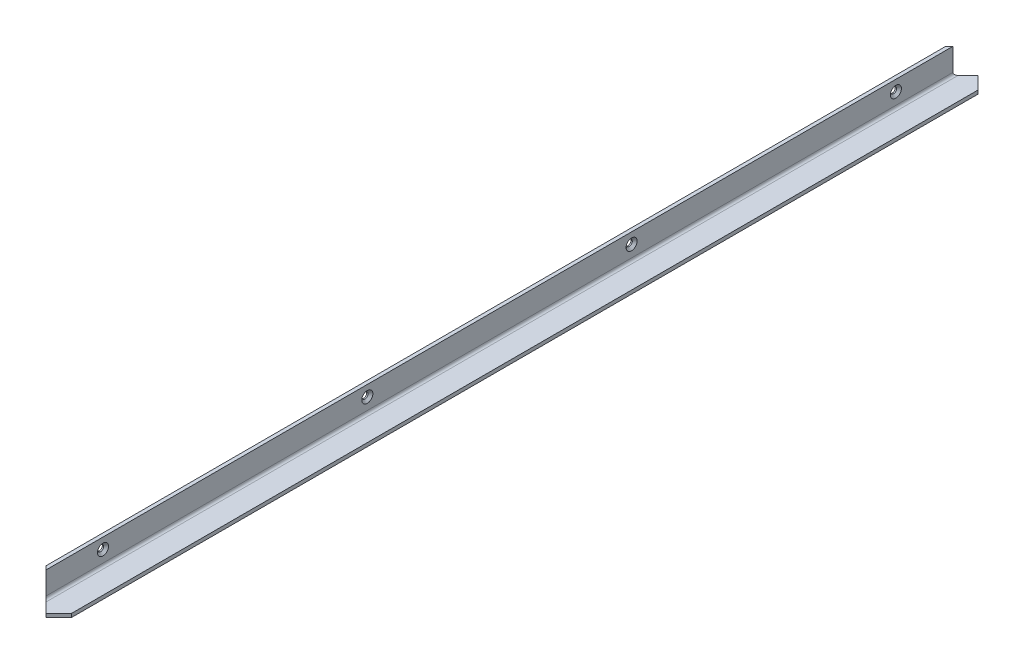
ISO-10303-21;
HEADER;
FILE_DESCRIPTION(('STEP AP214'),'2;1');
FILE_NAME('part.step','',(''),(''),'','','');
FILE_SCHEMA(('AUTOMOTIVE_DESIGN { 1 0 10303 214 1 1 1 1 }'));
ENDSEC;
DATA;
#1=APPLICATION_CONTEXT('core data for automotive mechanical design processes');
#2=APPLICATION_PROTOCOL_DEFINITION('international standard','automotive_design',2000,#1);
#3=PRODUCT_CONTEXT('',#1,'mechanical');
#4=PRODUCT('Part','Part','',(#3));
#5=PRODUCT_RELATED_PRODUCT_CATEGORY('part','',(#4));
#6=PRODUCT_DEFINITION_FORMATION('','',#4);
#7=PRODUCT_DEFINITION_CONTEXT('part definition',#1,'design');
#8=PRODUCT_DEFINITION('design','',#6,#7);
#9=PRODUCT_DEFINITION_SHAPE('','',#8);
#10=(LENGTH_UNIT() NAMED_UNIT(*) SI_UNIT(.MILLI.,.METRE.));
#11=(NAMED_UNIT(*) PLANE_ANGLE_UNIT() SI_UNIT($,.RADIAN.));
#12=(NAMED_UNIT(*) SI_UNIT($,.STERADIAN.) SOLID_ANGLE_UNIT());
#13=UNCERTAINTY_MEASURE_WITH_UNIT(LENGTH_MEASURE(1.E-05),#10,'distance_accuracy_value','');
#14=(GEOMETRIC_REPRESENTATION_CONTEXT(3) GLOBAL_UNCERTAINTY_ASSIGNED_CONTEXT((#13)) GLOBAL_UNIT_ASSIGNED_CONTEXT((#10,
#11,#12)) REPRESENTATION_CONTEXT('',''));
#15=CARTESIAN_POINT('',(0.,0.,0.));
#16=DIRECTION('',(0.,0.,1.));
#17=DIRECTION('',(1.,0.,0.));
#18=AXIS2_PLACEMENT_3D('',#15,#16,#17);
#19=CARTESIAN_POINT('',(0.,0.,1689.1));
#20=DIRECTION('',(0.,1.,0.));
#21=DIRECTION('',(0.,0.,1.));
#22=AXIS2_PLACEMENT_3D('',#19,#20,#21);
#23=PLANE('',#22);
#24=DIRECTION('',(0.,0.,-1.));
#25=VECTOR('',#24,1.);
#26=CARTESIAN_POINT('',(0.,0.,1689.1));
#27=LINE('',#26,#25);
#28=CARTESIAN_POINT('',(0.,0.,1638.3));
#29=VERTEX_POINT('',#28);
#30=CARTESIAN_POINT('',(0.,0.,50.8));
#31=VERTEX_POINT('',#30);
#32=EDGE_CURVE('E269',#29,#31,#27,.T.);
#33=ORIENTED_EDGE('',*,*,#32,.T.);
#34=DIRECTION('',(-0.707106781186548,0.,0.707106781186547));
#35=VECTOR('',#34,1.);
#36=CARTESIAN_POINT('',(28.4957415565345,0.,22.3042584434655));
#37=LINE('',#36,#35);
#38=CARTESIAN_POINT('',(28.4957415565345,0.,22.3042584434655));
#39=VERTEX_POINT('',#38);
#40=EDGE_CURVE('E120',#39,#31,#37,.T.);
#41=ORIENTED_EDGE('',*,*,#40,.F.);
#42=DIRECTION('',(-0.707106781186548,0.,-0.707106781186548));
#43=VECTOR('',#42,1.);
#44=CARTESIAN_POINT('',(50.8,0.,44.608516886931));
#45=LINE('',#44,#43);
#46=CARTESIAN_POINT('',(50.8,0.,44.608516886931));
#47=VERTEX_POINT('',#46);
#48=EDGE_CURVE('E104',#47,#39,#45,.T.);
#49=ORIENTED_EDGE('',*,*,#48,.F.);
#50=DIRECTION('',(0.,0.,-1.));
#51=VECTOR('',#50,1.);
#52=CARTESIAN_POINT('',(50.8,0.,1689.1));
#53=LINE('',#52,#51);
#54=CARTESIAN_POINT('',(50.8,0.,1644.49148311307));
#55=VERTEX_POINT('',#54);
#56=EDGE_CURVE('E119',#55,#47,#53,.T.);
#57=ORIENTED_EDGE('',*,*,#56,.F.);
#58=DIRECTION('',(0.707106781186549,0.,-0.707106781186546));
#59=VECTOR('',#58,1.);
#60=CARTESIAN_POINT('',(50.8,0.,1644.49148311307));
#61=LINE('',#60,#59);
#62=CARTESIAN_POINT('',(28.4957415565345,0.,1666.79574155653));
#63=VERTEX_POINT('',#62);
#64=EDGE_CURVE('E277',#63,#55,#61,.T.);
#65=ORIENTED_EDGE('',*,*,#64,.F.);
#66=DIRECTION('',(0.70710678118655,0.,0.707106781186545));
#67=VECTOR('',#66,1.);
#68=CARTESIAN_POINT('',(28.4957415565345,0.,1666.79574155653));
#69=LINE('',#68,#67);
#70=EDGE_CURVE('E247',#29,#63,#69,.T.);
#71=ORIENTED_EDGE('',*,*,#70,.F.);
#72=EDGE_LOOP('',(#33,#41,#49,#57,#65,#71));
#73=FACE_BOUND('',#72,.T.);
#74=ADVANCED_FACE('F27',(#73),#23,.F.);
#75=CARTESIAN_POINT('',(50.8,6.35,1689.1));
#76=DIRECTION('',(1.,0.,0.));
#77=DIRECTION('',(0.,0.,-1.));
#78=AXIS2_PLACEMENT_3D('',#75,#76,#77);
#79=PLANE('',#78);
#80=DIRECTION('',(0.,-1.,0.));
#81=VECTOR('',#80,1.);
#82=CARTESIAN_POINT('',(50.8,50.8,44.608516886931));
#83=LINE('',#82,#81);
#84=CARTESIAN_POINT('',(50.8,6.35,44.608516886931));
#85=VERTEX_POINT('',#84);
#86=EDGE_CURVE('E100',#85,#47,#83,.T.);
#87=ORIENTED_EDGE('',*,*,#86,.F.);
#88=DIRECTION('',(0.,0.,-1.));
#89=VECTOR('',#88,1.);
#90=CARTESIAN_POINT('',(50.8,6.35,1689.1));
#91=LINE('',#90,#89);
#92=CARTESIAN_POINT('',(50.8,6.35,1644.49148311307));
#93=VERTEX_POINT('',#92);
#94=EDGE_CURVE('E127',#93,#85,#91,.T.);
#95=ORIENTED_EDGE('',*,*,#94,.F.);
#96=DIRECTION('',(0.,-1.,0.));
#97=VECTOR('',#96,1.);
#98=CARTESIAN_POINT('',(50.8,50.8,1644.49148311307));
#99=LINE('',#98,#97);
#100=EDGE_CURVE('E125',#93,#55,#99,.T.);
#101=ORIENTED_EDGE('',*,*,#100,.T.);
#102=ORIENTED_EDGE('',*,*,#56,.T.);
#103=EDGE_LOOP('',(#87,#95,#101,#102));
#104=FACE_BOUND('',#103,.T.);
#105=ADVANCED_FACE('F124',(#104),#79,.T.);
#106=CARTESIAN_POINT('',(0.,6.35,1689.1));
#107=DIRECTION('',(0.,1.,0.));
#108=DIRECTION('',(0.,0.,1.));
#109=AXIS2_PLACEMENT_3D('',#106,#107,#108);
#110=PLANE('',#109);
#111=DIRECTION('',(0.707106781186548,0.,-0.707106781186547));
#112=VECTOR('',#111,1.);
#113=CARTESIAN_POINT('',(-819.15,6.35,869.95));
#114=LINE('',#113,#112);
#115=CARTESIAN_POINT('',(10.922,6.35,39.8780000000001));
#116=VERTEX_POINT('',#115);
#117=CARTESIAN_POINT('',(28.4957415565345,6.35,22.3042584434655));
#118=VERTEX_POINT('',#117);
#119=EDGE_CURVE('E246',#116,#118,#114,.T.);
#120=ORIENTED_EDGE('',*,*,#119,.F.);
#121=DIRECTION('',(0.,0.,-1.));
#122=VECTOR('',#121,1.);
#123=CARTESIAN_POINT('',(10.922,6.35,1689.1));
#124=LINE('',#123,#122);
#125=CARTESIAN_POINT('',(10.922,6.35,1649.222));
#126=VERTEX_POINT('',#125);
#127=EDGE_CURVE('E50',#116,#126,#124,.F.);
#128=ORIENTED_EDGE('',*,*,#127,.T.);
#129=DIRECTION('',(-0.70710678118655,0.,-0.707106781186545));
#130=VECTOR('',#129,1.);
#131=CARTESIAN_POINT('',(25.4,6.35,1663.7));
#132=LINE('',#131,#130);
#133=CARTESIAN_POINT('',(28.4957415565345,6.35,1666.79574155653));
#134=VERTEX_POINT('',#133);
#135=EDGE_CURVE('E254',#134,#126,#132,.T.);
#136=ORIENTED_EDGE('',*,*,#135,.F.);
#137=DIRECTION('',(-0.707106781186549,0.,0.707106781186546));
#138=VECTOR('',#137,1.);
#139=CARTESIAN_POINT('',(3.09574155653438,6.35,1692.19574155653));
#140=LINE('',#139,#138);
#141=EDGE_CURVE('E139',#93,#134,#140,.T.);
#142=ORIENTED_EDGE('',*,*,#141,.F.);
#143=ORIENTED_EDGE('',*,*,#94,.T.);
#144=DIRECTION('',(0.707106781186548,0.,0.707106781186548));
#145=VECTOR('',#144,1.);
#146=CARTESIAN_POINT('',(847.645741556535,6.35,841.454258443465));
#147=LINE('',#146,#145);
#148=EDGE_CURVE('E107',#118,#85,#147,.T.);
#149=ORIENTED_EDGE('',*,*,#148,.F.);
#150=EDGE_LOOP('',(#120,#128,#136,#142,#143,#149));
#151=FACE_BOUND('',#150,.T.);
#152=ADVANCED_FACE('F194',(#151),#110,.T.);
#153=CARTESIAN_POINT('',(6.35,50.8,1689.1));
#154=DIRECTION('',(1.,0.,0.));
#155=DIRECTION('',(0.,1.,0.));
#156=AXIS2_PLACEMENT_3D('',#153,#154,#155);
#157=PLANE('',#156);
#158=CARTESIAN_POINT('',(6.35,31.75,1544.066));
#159=DIRECTION('',(1.,0.,0.));
#160=DIRECTION('',(0.,1.,0.));
#161=AXIS2_PLACEMENT_3D('',#158,#159,#160);
#162=CIRCLE('',#161,9.7789999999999);
#163=CARTESIAN_POINT('',(6.35,41.5289999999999,1544.066));
#164=VERTEX_POINT('',#163);
#165=EDGE_CURVE('E162',#164,#164,#162,.F.);
#166=ORIENTED_EDGE('',*,*,#165,.T.);
#167=EDGE_LOOP('',(#166));
#168=FACE_BOUND('',#167,.T.);
#169=CARTESIAN_POINT('',(6.35,31.75,1077.722));
#170=DIRECTION('',(1.,0.,0.));
#171=DIRECTION('',(0.,1.,0.));
#172=AXIS2_PLACEMENT_3D('',#169,#170,#171);
#173=CIRCLE('',#172,9.7789999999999);
#174=CARTESIAN_POINT('',(6.35,41.5289999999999,1077.722));
#175=VERTEX_POINT('',#174);
#176=EDGE_CURVE('E159',#175,#175,#173,.F.);
#177=ORIENTED_EDGE('',*,*,#176,.T.);
#178=EDGE_LOOP('',(#177));
#179=FACE_BOUND('',#178,.T.);
#180=CARTESIAN_POINT('',(6.35,31.75,611.378));
#181=DIRECTION('',(1.,0.,0.));
#182=DIRECTION('',(0.,1.,0.));
#183=AXIS2_PLACEMENT_3D('',#180,#181,#182);
#184=CIRCLE('',#183,9.7789999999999);
#185=CARTESIAN_POINT('',(6.35,41.5289999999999,611.378));
#186=VERTEX_POINT('',#185);
#187=EDGE_CURVE('E156',#186,#186,#184,.F.);
#188=ORIENTED_EDGE('',*,*,#187,.T.);
#189=EDGE_LOOP('',(#188));
#190=FACE_BOUND('',#189,.T.);
#191=CARTESIAN_POINT('',(6.35,31.75,145.034));
#192=DIRECTION('',(1.,0.,0.));
#193=DIRECTION('',(0.,1.,0.));
#194=AXIS2_PLACEMENT_3D('',#191,#192,#193);
#195=CIRCLE('',#194,9.7789999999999);
#196=CARTESIAN_POINT('',(6.35,41.5289999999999,145.034));
#197=VERTEX_POINT('',#196);
#198=EDGE_CURVE('E153',#197,#197,#195,.F.);
#199=ORIENTED_EDGE('',*,*,#198,.T.);
#200=EDGE_LOOP('',(#199));
#201=FACE_BOUND('',#200,.T.);
#202=DIRECTION('',(0.,-1.,0.));
#203=VECTOR('',#202,1.);
#204=CARTESIAN_POINT('',(6.35,50.8,44.4500000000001));
#205=LINE('',#204,#203);
#206=CARTESIAN_POINT('',(6.3500000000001,50.8,44.4499999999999));
#207=VERTEX_POINT('',#206);
#208=CARTESIAN_POINT('',(6.35,10.922,44.4500000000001));
#209=VERTEX_POINT('',#208);
#210=EDGE_CURVE('E42',#207,#209,#205,.T.);
#211=ORIENTED_EDGE('',*,*,#210,.F.);
#212=DIRECTION('',(0.,0.,-1.));
#213=VECTOR('',#212,1.);
#214=CARTESIAN_POINT('',(6.35,50.8,1689.1));
#215=LINE('',#214,#213);
#216=CARTESIAN_POINT('',(6.35000000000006,50.8,1644.65));
#217=VERTEX_POINT('',#216);
#218=EDGE_CURVE('E131',#217,#207,#215,.T.);
#219=ORIENTED_EDGE('',*,*,#218,.F.);
#220=DIRECTION('',(0.,1.,0.));
#221=VECTOR('',#220,1.);
#222=CARTESIAN_POINT('',(6.35,50.8,1644.65));
#223=LINE('',#222,#221);
#224=CARTESIAN_POINT('',(6.35,10.922,1644.65));
#225=VERTEX_POINT('',#224);
#226=EDGE_CURVE('E251',#225,#217,#223,.T.);
#227=ORIENTED_EDGE('',*,*,#226,.F.);
#228=DIRECTION('',(0.,0.,-1.));
#229=VECTOR('',#228,1.);
#230=CARTESIAN_POINT('',(6.35,10.922,0.));
#231=LINE('',#230,#229);
#232=EDGE_CURVE('E126',#225,#209,#231,.T.);
#233=ORIENTED_EDGE('',*,*,#232,.T.);
#234=EDGE_LOOP('',(#211,#219,#227,#233));
#235=FACE_BOUND('',#234,.T.);
#236=ADVANCED_FACE('F239',(#168,#179,#190,#201,#235),#157,.T.);
#237=CARTESIAN_POINT('',(0.,50.8,1689.1));
#238=DIRECTION('',(0.,1.,0.));
#239=DIRECTION('',(0.,0.,1.));
#240=AXIS2_PLACEMENT_3D('',#237,#238,#239);
#241=PLANE('',#240);
#242=DIRECTION('',(-0.707106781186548,0.,0.707106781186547));
#243=VECTOR('',#242,1.);
#244=CARTESIAN_POINT('',(28.4957415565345,50.8,22.3042584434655));
#245=LINE('',#244,#243);
#246=CARTESIAN_POINT('',(0.,50.8,50.8));
#247=VERTEX_POINT('',#246);
#248=EDGE_CURVE('E113',#207,#247,#245,.T.);
#249=ORIENTED_EDGE('',*,*,#248,.T.);
#250=DIRECTION('',(0.,0.,-1.));
#251=VECTOR('',#250,1.);
#252=CARTESIAN_POINT('',(0.,50.8,1689.1));
#253=LINE('',#252,#251);
#254=CARTESIAN_POINT('',(0.,50.8,1638.3));
#255=VERTEX_POINT('',#254);
#256=EDGE_CURVE('E271',#255,#247,#253,.T.);
#257=ORIENTED_EDGE('',*,*,#256,.F.);
#258=DIRECTION('',(0.70710678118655,0.,0.707106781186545));
#259=VECTOR('',#258,1.);
#260=CARTESIAN_POINT('',(28.4957415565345,50.8,1666.79574155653));
#261=LINE('',#260,#259);
#262=EDGE_CURVE('E275',#255,#217,#261,.T.);
#263=ORIENTED_EDGE('',*,*,#262,.T.);
#264=ORIENTED_EDGE('',*,*,#218,.T.);
#265=EDGE_LOOP('',(#249,#257,#263,#264));
#266=FACE_BOUND('',#265,.T.);
#267=ADVANCED_FACE('F235',(#266),#241,.T.);
#268=CARTESIAN_POINT('',(0.,50.8,1689.1));
#269=DIRECTION('',(1.,0.,0.));
#270=DIRECTION('',(0.,1.,0.));
#271=AXIS2_PLACEMENT_3D('',#268,#269,#270);
#272=PLANE('',#271);
#273=CARTESIAN_POINT('',(0.,31.75,1077.722));
#274=DIRECTION('',(-1.,0.,0.));
#275=DIRECTION('',(0.,-1.,0.));
#276=AXIS2_PLACEMENT_3D('',#273,#274,#275);
#277=CIRCLE('',#276,5.20699999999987);
#278=CARTESIAN_POINT('',(0.,26.5430000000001,1077.722));
#279=VERTEX_POINT('',#278);
#280=EDGE_CURVE('E121',#279,#279,#277,.T.);
#281=ORIENTED_EDGE('',*,*,#280,.F.);
#282=EDGE_LOOP('',(#281));
#283=FACE_BOUND('',#282,.T.);
#284=CARTESIAN_POINT('',(0.,31.75,1544.066));
#285=DIRECTION('',(-1.,0.,0.));
#286=DIRECTION('',(0.,-1.,0.));
#287=AXIS2_PLACEMENT_3D('',#284,#285,#286);
#288=CIRCLE('',#287,5.20699999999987);
#289=CARTESIAN_POINT('',(0.,26.5430000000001,1544.066));
#290=VERTEX_POINT('',#289);
#291=EDGE_CURVE('E259',#290,#290,#288,.T.);
#292=ORIENTED_EDGE('',*,*,#291,.F.);
#293=EDGE_LOOP('',(#292));
#294=FACE_BOUND('',#293,.T.);
#295=ORIENTED_EDGE('',*,*,#256,.T.);
#296=DIRECTION('',(0.,-1.,0.));
#297=VECTOR('',#296,1.);
#298=CARTESIAN_POINT('',(0.,50.8,50.8));
#299=LINE('',#298,#297);
#300=EDGE_CURVE('E286',#247,#31,#299,.T.);
#301=ORIENTED_EDGE('',*,*,#300,.T.);
#302=ORIENTED_EDGE('',*,*,#32,.F.);
#303=DIRECTION('',(0.,-1.,0.));
#304=VECTOR('',#303,1.);
#305=CARTESIAN_POINT('',(0.,50.8,1638.3));
#306=LINE('',#305,#304);
#307=EDGE_CURVE('E264',#255,#29,#306,.T.);
#308=ORIENTED_EDGE('',*,*,#307,.F.);
#309=EDGE_LOOP('',(#295,#301,#302,#308));
#310=FACE_BOUND('',#309,.T.);
#311=CARTESIAN_POINT('',(0.,31.75,611.378));
#312=DIRECTION('',(-1.,0.,0.));
#313=DIRECTION('',(0.,-1.,0.));
#314=AXIS2_PLACEMENT_3D('',#311,#312,#313);
#315=CIRCLE('',#314,5.20699999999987);
#316=CARTESIAN_POINT('',(0.,26.5430000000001,611.378));
#317=VERTEX_POINT('',#316);
#318=EDGE_CURVE('E144',#317,#317,#315,.T.);
#319=ORIENTED_EDGE('',*,*,#318,.F.);
#320=EDGE_LOOP('',(#319));
#321=FACE_BOUND('',#320,.T.);
#322=CARTESIAN_POINT('',(0.,31.75,145.034));
#323=DIRECTION('',(-1.,0.,0.));
#324=DIRECTION('',(0.,-1.,0.));
#325=AXIS2_PLACEMENT_3D('',#322,#323,#324);
#326=CIRCLE('',#325,5.20699999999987);
#327=CARTESIAN_POINT('',(0.,26.5430000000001,145.034));
#328=VERTEX_POINT('',#327);
#329=EDGE_CURVE('E147',#328,#328,#326,.T.);
#330=ORIENTED_EDGE('',*,*,#329,.F.);
#331=EDGE_LOOP('',(#330));
#332=FACE_BOUND('',#331,.T.);
#333=ADVANCED_FACE('F231',(#283,#294,#310,#321,#332),#272,.F.);
#334=CARTESIAN_POINT('',(10.922,10.922,1689.1));
#335=DIRECTION('',(0.,0.,1.));
#336=DIRECTION('',(1.,0.,0.));
#337=AXIS2_PLACEMENT_3D('',#334,#335,#336);
#338=CYLINDRICAL_SURFACE('',#337,4.572);
#339=ORIENTED_EDGE('',*,*,#127,.F.);
#340=CARTESIAN_POINT('',(10.922,10.922,39.8780000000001));
#341=DIRECTION('',(0.707106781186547,0.,0.707106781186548));
#342=DIRECTION('',(-0.707106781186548,0.,0.707106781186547));
#343=AXIS2_PLACEMENT_3D('',#340,#341,#342);
#344=ELLIPSE('',#343,6.46578440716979,4.572);
#345=EDGE_CURVE('E141',#116,#209,#344,.F.);
#346=ORIENTED_EDGE('',*,*,#345,.T.);
#347=ORIENTED_EDGE('',*,*,#232,.F.);
#348=CARTESIAN_POINT('',(10.922,10.922,1649.222));
#349=DIRECTION('',(0.707106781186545,0.,-0.707106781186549));
#350=DIRECTION('',(0.70710678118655,0.,0.707106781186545));
#351=AXIS2_PLACEMENT_3D('',#348,#349,#350);
#352=ELLIPSE('',#351,6.46578440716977,4.572);
#353=EDGE_CURVE('E136',#225,#126,#352,.F.);
#354=ORIENTED_EDGE('',*,*,#353,.T.);
#355=EDGE_LOOP('',(#339,#346,#347,#354));
#356=FACE_BOUND('',#355,.T.);
#357=ADVANCED_FACE('F227',(#356),#338,.F.);
#358=CARTESIAN_POINT('',(50.8,31.75,1544.066));
#359=DIRECTION('',(-1.,0.,0.));
#360=DIRECTION('',(0.,-1.,0.));
#361=AXIS2_PLACEMENT_3D('',#358,#359,#360);
#362=CYLINDRICAL_SURFACE('',#361,5.20699999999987);
#363=CARTESIAN_POINT('',(2.37562103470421,31.75,1544.066));
#364=DIRECTION('',(1.,0.,0.));
#365=DIRECTION('',(0.,0.,-1.));
#366=AXIS2_PLACEMENT_3D('',#363,#364,#365);
#367=CIRCLE('',#366,5.20699999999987);
#368=CARTESIAN_POINT('',(2.37562103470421,31.75,1538.859));
#369=VERTEX_POINT('',#368);
#370=EDGE_CURVE('E150',#369,#369,#367,.T.);
#371=ORIENTED_EDGE('',*,*,#370,.T.);
#372=EDGE_LOOP('',(#371));
#373=FACE_BOUND('',#372,.T.);
#374=ORIENTED_EDGE('',*,*,#291,.T.);
#375=EDGE_LOOP('',(#374));
#376=FACE_BOUND('',#375,.T.);
#377=ADVANCED_FACE('F221',(#373,#376),#362,.F.);
#378=CARTESIAN_POINT('',(50.8,50.8,1644.49148311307));
#379=DIRECTION('',(-0.707106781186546,0.,-0.707106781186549));
#380=DIRECTION('',(-0.707106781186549,0.,0.707106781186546));
#381=AXIS2_PLACEMENT_3D('',#378,#379,#380);
#382=PLANE('',#381);
#383=ORIENTED_EDGE('',*,*,#141,.T.);
#384=DIRECTION('',(0.,-1.,0.));
#385=VECTOR('',#384,1.);
#386=CARTESIAN_POINT('',(28.4957415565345,50.8,1666.79574155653));
#387=LINE('',#386,#385);
#388=EDGE_CURVE('E261',#134,#63,#387,.T.);
#389=ORIENTED_EDGE('',*,*,#388,.T.);
#390=ORIENTED_EDGE('',*,*,#64,.T.);
#391=ORIENTED_EDGE('',*,*,#100,.F.);
#392=EDGE_LOOP('',(#383,#389,#390,#391));
#393=FACE_BOUND('',#392,.T.);
#394=ADVANCED_FACE('F218',(#393),#382,.F.);
#395=CARTESIAN_POINT('',(28.4957415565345,50.8,1666.79574155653));
#396=DIRECTION('',(0.707106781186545,0.,-0.707106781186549));
#397=DIRECTION('',(-0.70710678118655,0.,-0.707106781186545));
#398=AXIS2_PLACEMENT_3D('',#395,#396,#397);
#399=PLANE('',#398);
#400=ORIENTED_EDGE('',*,*,#135,.T.);
#401=ORIENTED_EDGE('',*,*,#353,.F.);
#402=ORIENTED_EDGE('',*,*,#226,.T.);
#403=ORIENTED_EDGE('',*,*,#262,.F.);
#404=ORIENTED_EDGE('',*,*,#307,.T.);
#405=ORIENTED_EDGE('',*,*,#70,.T.);
#406=ORIENTED_EDGE('',*,*,#388,.F.);
#407=EDGE_LOOP('',(#400,#401,#402,#403,#404,#405,#406));
#408=FACE_BOUND('',#407,.T.);
#409=ADVANCED_FACE('F216',(#408),#399,.F.);
#410=CARTESIAN_POINT('',(28.4957415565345,50.8,22.3042584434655));
#411=DIRECTION('',(0.707106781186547,0.,0.707106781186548));
#412=DIRECTION('',(0.707106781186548,0.,-0.707106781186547));
#413=AXIS2_PLACEMENT_3D('',#410,#411,#412);
#414=PLANE('',#413);
#415=ORIENTED_EDGE('',*,*,#119,.T.);
#416=DIRECTION('',(0.,-1.,0.));
#417=VECTOR('',#416,1.);
#418=CARTESIAN_POINT('',(28.4957415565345,50.8,22.3042584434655));
#419=LINE('',#418,#417);
#420=EDGE_CURVE('E112',#118,#39,#419,.T.);
#421=ORIENTED_EDGE('',*,*,#420,.T.);
#422=ORIENTED_EDGE('',*,*,#40,.T.);
#423=ORIENTED_EDGE('',*,*,#300,.F.);
#424=ORIENTED_EDGE('',*,*,#248,.F.);
#425=ORIENTED_EDGE('',*,*,#210,.T.);
#426=ORIENTED_EDGE('',*,*,#345,.F.);
#427=EDGE_LOOP('',(#415,#421,#422,#423,#424,#425,#426));
#428=FACE_BOUND('',#427,.T.);
#429=ADVANCED_FACE('F210',(#428),#414,.F.);
#430=CARTESIAN_POINT('',(50.8,50.8,44.608516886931));
#431=DIRECTION('',(-0.707106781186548,0.,0.707106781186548));
#432=DIRECTION('',(0.707106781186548,0.,0.707106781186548));
#433=AXIS2_PLACEMENT_3D('',#430,#431,#432);
#434=PLANE('',#433);
#435=ORIENTED_EDGE('',*,*,#148,.T.);
#436=ORIENTED_EDGE('',*,*,#86,.T.);
#437=ORIENTED_EDGE('',*,*,#48,.T.);
#438=ORIENTED_EDGE('',*,*,#420,.F.);
#439=EDGE_LOOP('',(#435,#436,#437,#438));
#440=FACE_BOUND('',#439,.T.);
#441=ADVANCED_FACE('F102',(#440),#434,.F.);
#442=CARTESIAN_POINT('',(50.8,31.75,1077.722));
#443=DIRECTION('',(-1.,0.,0.));
#444=DIRECTION('',(0.,-1.,0.));
#445=AXIS2_PLACEMENT_3D('',#442,#443,#444);
#446=CYLINDRICAL_SURFACE('',#445,5.20699999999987);
#447=CARTESIAN_POINT('',(2.37562103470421,31.75,1077.722));
#448=DIRECTION('',(1.,0.,0.));
#449=DIRECTION('',(0.,0.,-1.));
#450=AXIS2_PLACEMENT_3D('',#447,#448,#449);
#451=CIRCLE('',#450,5.20699999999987);
#452=CARTESIAN_POINT('',(2.37562103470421,31.75,1072.515));
#453=VERTEX_POINT('',#452);
#454=EDGE_CURVE('E165',#453,#453,#451,.T.);
#455=ORIENTED_EDGE('',*,*,#454,.T.);
#456=EDGE_LOOP('',(#455));
#457=FACE_BOUND('',#456,.T.);
#458=ORIENTED_EDGE('',*,*,#280,.T.);
#459=EDGE_LOOP('',(#458));
#460=FACE_BOUND('',#459,.T.);
#461=ADVANCED_FACE('F198',(#457,#460),#446,.F.);
#462=CARTESIAN_POINT('',(50.8,31.75,611.378));
#463=DIRECTION('',(-1.,0.,0.));
#464=DIRECTION('',(0.,-1.,0.));
#465=AXIS2_PLACEMENT_3D('',#462,#463,#464);
#466=CYLINDRICAL_SURFACE('',#465,5.20699999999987);
#467=CARTESIAN_POINT('',(2.37562103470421,31.75,611.378));
#468=DIRECTION('',(1.,0.,0.));
#469=DIRECTION('',(0.,0.,-1.));
#470=AXIS2_PLACEMENT_3D('',#467,#468,#469);
#471=CIRCLE('',#470,5.20699999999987);
#472=CARTESIAN_POINT('',(2.37562103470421,31.75,606.171));
#473=VERTEX_POINT('',#472);
#474=EDGE_CURVE('E35',#473,#473,#471,.T.);
#475=ORIENTED_EDGE('',*,*,#474,.T.);
#476=EDGE_LOOP('',(#475));
#477=FACE_BOUND('',#476,.T.);
#478=ORIENTED_EDGE('',*,*,#318,.T.);
#479=EDGE_LOOP('',(#478));
#480=FACE_BOUND('',#479,.T.);
#481=ADVANCED_FACE('F170',(#477,#480),#466,.F.);
#482=CARTESIAN_POINT('',(50.8,31.75,145.034));
#483=DIRECTION('',(-1.,0.,0.));
#484=DIRECTION('',(0.,-1.,0.));
#485=AXIS2_PLACEMENT_3D('',#482,#483,#484);
#486=CYLINDRICAL_SURFACE('',#485,5.20699999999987);
#487=CARTESIAN_POINT('',(2.37562103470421,31.75,145.034));
#488=DIRECTION('',(1.,0.,0.));
#489=DIRECTION('',(0.,0.,-1.));
#490=AXIS2_PLACEMENT_3D('',#487,#488,#489);
#491=CIRCLE('',#490,5.20699999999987);
#492=CARTESIAN_POINT('',(2.37562103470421,31.75,139.827));
#493=VERTEX_POINT('',#492);
#494=EDGE_CURVE('E11',#493,#493,#491,.T.);
#495=ORIENTED_EDGE('',*,*,#494,.T.);
#496=EDGE_LOOP('',(#495));
#497=FACE_BOUND('',#496,.T.);
#498=ORIENTED_EDGE('',*,*,#329,.T.);
#499=EDGE_LOOP('',(#498));
#500=FACE_BOUND('',#499,.T.);
#501=ADVANCED_FACE('F29',(#497,#500),#486,.F.);
#502=CARTESIAN_POINT('',(2.37562103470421,31.75,1544.066));
#503=DIRECTION('',(1.,0.,0.));
#504=DIRECTION('',(0.,0.,-1.));
#505=AXIS2_PLACEMENT_3D('',#502,#503,#504);
#506=CONICAL_SURFACE('',#505,5.20699999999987,0.855211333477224);
#507=ORIENTED_EDGE('',*,*,#165,.F.);
#508=EDGE_LOOP('',(#507));
#509=FACE_BOUND('',#508,.T.);
#510=ORIENTED_EDGE('',*,*,#370,.F.);
#511=EDGE_LOOP('',(#510));
#512=FACE_BOUND('',#511,.T.);
#513=ADVANCED_FACE('F185',(#509,#512),#506,.F.);
#514=CARTESIAN_POINT('',(2.37562103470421,31.75,1077.722));
#515=DIRECTION('',(1.,0.,0.));
#516=DIRECTION('',(0.,0.,-1.));
#517=AXIS2_PLACEMENT_3D('',#514,#515,#516);
#518=CONICAL_SURFACE('',#517,5.20699999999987,0.855211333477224);
#519=ORIENTED_EDGE('',*,*,#176,.F.);
#520=EDGE_LOOP('',(#519));
#521=FACE_BOUND('',#520,.T.);
#522=ORIENTED_EDGE('',*,*,#454,.F.);
#523=EDGE_LOOP('',(#522));
#524=FACE_BOUND('',#523,.T.);
#525=ADVANCED_FACE('F176',(#521,#524),#518,.F.);
#526=CARTESIAN_POINT('',(2.37562103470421,31.75,611.378));
#527=DIRECTION('',(1.,0.,0.));
#528=DIRECTION('',(0.,0.,-1.));
#529=AXIS2_PLACEMENT_3D('',#526,#527,#528);
#530=CONICAL_SURFACE('',#529,5.20699999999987,0.855211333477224);
#531=ORIENTED_EDGE('',*,*,#187,.F.);
#532=EDGE_LOOP('',(#531));
#533=FACE_BOUND('',#532,.T.);
#534=ORIENTED_EDGE('',*,*,#474,.F.);
#535=EDGE_LOOP('',(#534));
#536=FACE_BOUND('',#535,.T.);
#537=ADVANCED_FACE('F173',(#533,#536),#530,.F.);
#538=CARTESIAN_POINT('',(2.37562103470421,31.75,145.034));
#539=DIRECTION('',(1.,0.,0.));
#540=DIRECTION('',(0.,0.,-1.));
#541=AXIS2_PLACEMENT_3D('',#538,#539,#540);
#542=CONICAL_SURFACE('',#541,5.20699999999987,0.855211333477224);
#543=ORIENTED_EDGE('',*,*,#198,.F.);
#544=EDGE_LOOP('',(#543));
#545=FACE_BOUND('',#544,.T.);
#546=ORIENTED_EDGE('',*,*,#494,.F.);
#547=EDGE_LOOP('',(#546));
#548=FACE_BOUND('',#547,.T.);
#549=ADVANCED_FACE('F175',(#545,#548),#542,.F.);
#550=CLOSED_SHELL('',(#74,#105,#152,#236,#267,#333,#357,#377,#394,#409,#429,#441,#461,#481,#501,
#513,#525,#537,#549));
#551=MANIFOLD_SOLID_BREP('B2',#550);
#552=ADVANCED_BREP_SHAPE_REPRESENTATION('',(#18,#551),#14);
#553=SHAPE_DEFINITION_REPRESENTATION(#9,#552);
ENDSEC;
END-ISO-10303-21;
